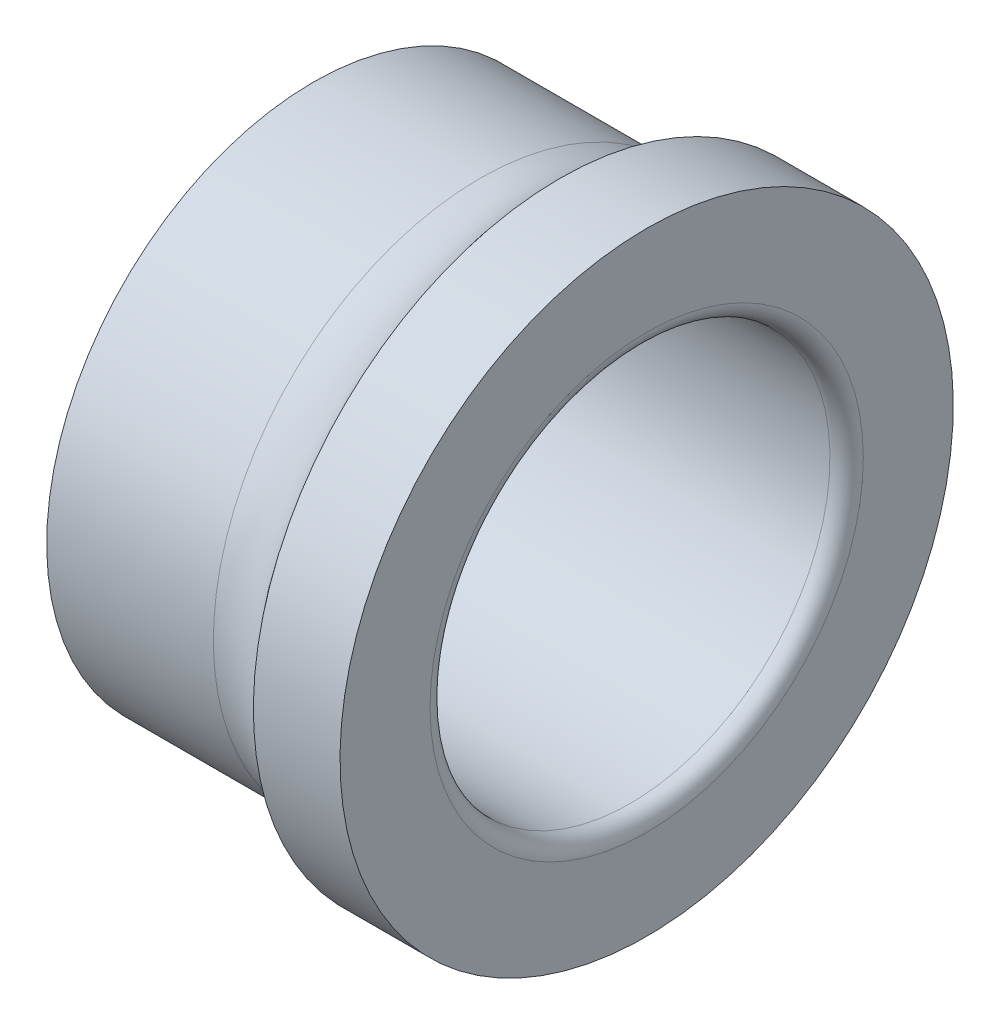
ISO-10303-21;
HEADER;
FILE_DESCRIPTION(('STEP AP214'),'2;1');
FILE_NAME('part.step','',(''),(''),'','','');
FILE_SCHEMA(('AUTOMOTIVE_DESIGN { 1 0 10303 214 1 1 1 1 }'));
ENDSEC;
DATA;
#1=APPLICATION_CONTEXT('core data for automotive mechanical design processes');
#2=APPLICATION_PROTOCOL_DEFINITION('international standard','automotive_design',2000,#1);
#3=PRODUCT_CONTEXT('',#1,'mechanical');
#4=PRODUCT('Part','Part','',(#3));
#5=PRODUCT_RELATED_PRODUCT_CATEGORY('part','',(#4));
#6=PRODUCT_DEFINITION_FORMATION('','',#4);
#7=PRODUCT_DEFINITION_CONTEXT('part definition',#1,'design');
#8=PRODUCT_DEFINITION('design','',#6,#7);
#9=PRODUCT_DEFINITION_SHAPE('','',#8);
#10=(LENGTH_UNIT() NAMED_UNIT(*) SI_UNIT(.MILLI.,.METRE.));
#11=(NAMED_UNIT(*) PLANE_ANGLE_UNIT() SI_UNIT($,.RADIAN.));
#12=(NAMED_UNIT(*) SI_UNIT($,.STERADIAN.) SOLID_ANGLE_UNIT());
#13=UNCERTAINTY_MEASURE_WITH_UNIT(LENGTH_MEASURE(1.E-05),#10,'distance_accuracy_value','');
#14=(GEOMETRIC_REPRESENTATION_CONTEXT(3) GLOBAL_UNCERTAINTY_ASSIGNED_CONTEXT((#13)) GLOBAL_UNIT_ASSIGNED_CONTEXT((#10,
#11,#12)) REPRESENTATION_CONTEXT('',''));
#15=CARTESIAN_POINT('',(0.,0.,0.));
#16=DIRECTION('',(0.,0.,1.));
#17=DIRECTION('',(1.,0.,0.));
#18=AXIS2_PLACEMENT_3D('',#15,#16,#17);
#19=CARTESIAN_POINT('',(0.,7.25,0.));
#20=DIRECTION('',(-1.,0.,0.));
#21=DIRECTION('',(0.,0.,1.));
#22=AXIS2_PLACEMENT_3D('',#19,#20,#21);
#23=PLANE('',#22);
#24=CARTESIAN_POINT('',(0.,0.,0.));
#25=DIRECTION('',(-1.,0.,0.));
#26=DIRECTION('',(0.,1.,0.));
#27=AXIS2_PLACEMENT_3D('',#24,#25,#26);
#28=CIRCLE('',#27,6.5);
#29=CARTESIAN_POINT('',(0.,6.5,0.));
#30=VERTEX_POINT('',#29);
#31=EDGE_CURVE('E33',#30,#30,#28,.T.);
#32=ORIENTED_EDGE('',*,*,#31,.F.);
#33=EDGE_LOOP('',(#32));
#34=FACE_BOUND('',#33,.T.);
#35=CARTESIAN_POINT('',(0.,0.,0.));
#36=DIRECTION('',(-1.,0.,0.));
#37=DIRECTION('',(0.,1.,0.));
#38=AXIS2_PLACEMENT_3D('',#35,#36,#37);
#39=CIRCLE('',#38,8.);
#40=CARTESIAN_POINT('',(0.,8.,0.));
#41=VERTEX_POINT('',#40);
#42=EDGE_CURVE('E10',#41,#41,#39,.T.);
#43=ORIENTED_EDGE('',*,*,#42,.T.);
#44=EDGE_LOOP('',(#43));
#45=FACE_BOUND('',#44,.T.);
#46=ADVANCED_FACE('F15',(#34,#45),#23,.T.);
#47=CARTESIAN_POINT('',(10.,7.85,0.));
#48=DIRECTION('',(1.,0.,0.));
#49=DIRECTION('',(0.,0.,-1.));
#50=AXIS2_PLACEMENT_3D('',#47,#48,#49);
#51=PLANE('',#50);
#52=CARTESIAN_POINT('',(10.,0.,0.));
#53=DIRECTION('',(-1.,0.,0.));
#54=DIRECTION('',(0.,1.,0.));
#55=AXIS2_PLACEMENT_3D('',#52,#53,#54);
#56=CIRCLE('',#55,6.5);
#57=CARTESIAN_POINT('',(10.,6.5,0.));
#58=VERTEX_POINT('',#57);
#59=EDGE_CURVE('E24',#58,#58,#56,.T.);
#60=ORIENTED_EDGE('',*,*,#59,.T.);
#61=EDGE_LOOP('',(#60));
#62=FACE_BOUND('',#61,.T.);
#63=CARTESIAN_POINT('',(10.,0.,0.));
#64=DIRECTION('',(-1.,0.,0.));
#65=DIRECTION('',(0.,1.,0.));
#66=AXIS2_PLACEMENT_3D('',#63,#64,#65);
#67=CIRCLE('',#66,9.2);
#68=CARTESIAN_POINT('',(10.,9.2,0.));
#69=VERTEX_POINT('',#68);
#70=EDGE_CURVE('E49',#69,#69,#67,.T.);
#71=ORIENTED_EDGE('',*,*,#70,.F.);
#72=EDGE_LOOP('',(#71));
#73=FACE_BOUND('',#72,.T.);
#74=ADVANCED_FACE('F63',(#62,#73),#51,.T.);
#75=CARTESIAN_POINT('',(0.5,0.,0.));
#76=DIRECTION('',(-1.,0.,0.));
#77=DIRECTION('',(0.,0.,1.));
#78=AXIS2_PLACEMENT_3D('',#75,#76,#77);
#79=TOROIDAL_SURFACE('',#78,6.5,0.5);
#80=ORIENTED_EDGE('',*,*,#31,.T.);
#81=EDGE_LOOP('',(#80));
#82=FACE_BOUND('',#81,.T.);
#83=CARTESIAN_POINT('',(0.5,0.,0.));
#84=DIRECTION('',(-1.,0.,0.));
#85=DIRECTION('',(0.,1.,0.));
#86=AXIS2_PLACEMENT_3D('',#83,#84,#85);
#87=CIRCLE('',#86,6.);
#88=CARTESIAN_POINT('',(0.5,6.,0.));
#89=VERTEX_POINT('',#88);
#90=EDGE_CURVE('E38',#89,#89,#87,.T.);
#91=ORIENTED_EDGE('',*,*,#90,.F.);
#92=EDGE_LOOP('',(#91));
#93=FACE_BOUND('',#92,.T.);
#94=ADVANCED_FACE('F59',(#82,#93),#79,.T.);
#95=CARTESIAN_POINT('',(5.,0.,0.));
#96=DIRECTION('',(-1.,0.,0.));
#97=DIRECTION('',(0.,0.,1.));
#98=AXIS2_PLACEMENT_3D('',#95,#96,#97);
#99=CYLINDRICAL_SURFACE('',#98,6.);
#100=CARTESIAN_POINT('',(9.5,0.,0.));
#101=DIRECTION('',(-1.,0.,0.));
#102=DIRECTION('',(0.,1.,0.));
#103=AXIS2_PLACEMENT_3D('',#100,#101,#102);
#104=CIRCLE('',#103,6.);
#105=CARTESIAN_POINT('',(9.5,6.,0.));
#106=VERTEX_POINT('',#105);
#107=EDGE_CURVE('E37',#106,#106,#104,.T.);
#108=ORIENTED_EDGE('',*,*,#107,.F.);
#109=EDGE_LOOP('',(#108));
#110=FACE_BOUND('',#109,.T.);
#111=ORIENTED_EDGE('',*,*,#90,.T.);
#112=EDGE_LOOP('',(#111));
#113=FACE_BOUND('',#112,.T.);
#114=ADVANCED_FACE('F17',(#110,#113),#99,.F.);
#115=CARTESIAN_POINT('',(9.5,0.,0.));
#116=DIRECTION('',(-1.,0.,0.));
#117=DIRECTION('',(0.,0.,1.));
#118=AXIS2_PLACEMENT_3D('',#115,#116,#117);
#119=TOROIDAL_SURFACE('',#118,6.5,0.500000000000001);
#120=ORIENTED_EDGE('',*,*,#107,.T.);
#121=EDGE_LOOP('',(#120));
#122=FACE_BOUND('',#121,.T.);
#123=ORIENTED_EDGE('',*,*,#59,.F.);
#124=EDGE_LOOP('',(#123));
#125=FACE_BOUND('',#124,.T.);
#126=ADVANCED_FACE('F66',(#122,#125),#119,.T.);
#127=CARTESIAN_POINT('',(8.7,0.,0.));
#128=DIRECTION('',(-1.,0.,0.));
#129=DIRECTION('',(0.,0.,1.));
#130=AXIS2_PLACEMENT_3D('',#127,#128,#129);
#131=CYLINDRICAL_SURFACE('',#130,9.2);
#132=CARTESIAN_POINT('',(7.4,0.,0.));
#133=DIRECTION('',(-1.,0.,0.));
#134=DIRECTION('',(0.,1.,0.));
#135=AXIS2_PLACEMENT_3D('',#132,#133,#134);
#136=CIRCLE('',#135,9.2);
#137=CARTESIAN_POINT('',(7.4,9.2,0.));
#138=VERTEX_POINT('',#137);
#139=EDGE_CURVE('E45',#138,#138,#136,.T.);
#140=ORIENTED_EDGE('',*,*,#139,.F.);
#141=EDGE_LOOP('',(#140));
#142=FACE_BOUND('',#141,.T.);
#143=ORIENTED_EDGE('',*,*,#70,.T.);
#144=EDGE_LOOP('',(#143));
#145=FACE_BOUND('',#144,.T.);
#146=ADVANCED_FACE('F69',(#142,#145),#131,.T.);
#147=CARTESIAN_POINT('',(5.00000000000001,0.,0.));
#148=DIRECTION('',(-1.,0.,0.));
#149=DIRECTION('',(0.,0.,1.));
#150=AXIS2_PLACEMENT_3D('',#147,#148,#149);
#151=TOROIDAL_SURFACE('',#150,11.,2.99999999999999);
#152=ORIENTED_EDGE('',*,*,#139,.T.);
#153=EDGE_LOOP('',(#152));
#154=FACE_BOUND('',#153,.T.);
#155=CARTESIAN_POINT('',(5.,0.,0.));
#156=DIRECTION('',(-1.,0.,0.));
#157=DIRECTION('',(0.,1.,0.));
#158=AXIS2_PLACEMENT_3D('',#155,#156,#157);
#159=CIRCLE('',#158,8.);
#160=CARTESIAN_POINT('',(5.,8.,0.));
#161=VERTEX_POINT('',#160);
#162=EDGE_CURVE('E50',#161,#161,#159,.T.);
#163=ORIENTED_EDGE('',*,*,#162,.F.);
#164=EDGE_LOOP('',(#163));
#165=FACE_BOUND('',#164,.T.);
#166=ADVANCED_FACE('F73',(#154,#165),#151,.F.);
#167=CARTESIAN_POINT('',(2.5,0.,0.));
#168=DIRECTION('',(-1.,0.,0.));
#169=DIRECTION('',(0.,0.,1.));
#170=AXIS2_PLACEMENT_3D('',#167,#168,#169);
#171=CYLINDRICAL_SURFACE('',#170,8.);
#172=ORIENTED_EDGE('',*,*,#42,.F.);
#173=EDGE_LOOP('',(#172));
#174=FACE_BOUND('',#173,.T.);
#175=ORIENTED_EDGE('',*,*,#162,.T.);
#176=EDGE_LOOP('',(#175));
#177=FACE_BOUND('',#176,.T.);
#178=ADVANCED_FACE('F76',(#174,#177),#171,.T.);
#179=CLOSED_SHELL('',(#46,#74,#94,#114,#126,#146,#166,#178));
#180=MANIFOLD_SOLID_BREP('B1',#179);
#181=ADVANCED_BREP_SHAPE_REPRESENTATION('',(#18,#180),#14);
#182=SHAPE_DEFINITION_REPRESENTATION(#9,#181);
ENDSEC;
END-ISO-10303-21;
